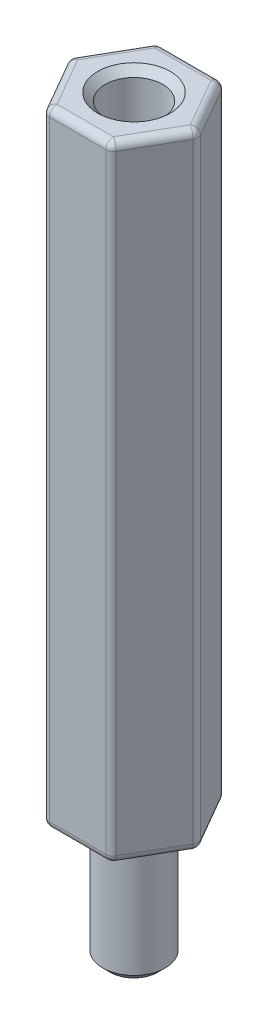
ISO-10303-21;
HEADER;
FILE_DESCRIPTION(('STEP AP214'),'2;1');
FILE_NAME('part.step','',(''),(''),'','','');
FILE_SCHEMA(('AUTOMOTIVE_DESIGN { 1 0 10303 214 1 1 1 1 }'));
ENDSEC;
DATA;
#1=APPLICATION_CONTEXT('core data for automotive mechanical design processes');
#2=APPLICATION_PROTOCOL_DEFINITION('international standard','automotive_design',2000,#1);
#3=PRODUCT_CONTEXT('',#1,'mechanical');
#4=PRODUCT('Part','Part','',(#3));
#5=PRODUCT_RELATED_PRODUCT_CATEGORY('part','',(#4));
#6=PRODUCT_DEFINITION_FORMATION('','',#4);
#7=PRODUCT_DEFINITION_CONTEXT('part definition',#1,'design');
#8=PRODUCT_DEFINITION('design','',#6,#7);
#9=PRODUCT_DEFINITION_SHAPE('','',#8);
#10=(LENGTH_UNIT() NAMED_UNIT(*) SI_UNIT(.MILLI.,.METRE.));
#11=(NAMED_UNIT(*) PLANE_ANGLE_UNIT() SI_UNIT($,.RADIAN.));
#12=(NAMED_UNIT(*) SI_UNIT($,.STERADIAN.) SOLID_ANGLE_UNIT());
#13=UNCERTAINTY_MEASURE_WITH_UNIT(LENGTH_MEASURE(1.E-05),#10,'distance_accuracy_value','');
#14=(GEOMETRIC_REPRESENTATION_CONTEXT(3) GLOBAL_UNCERTAINTY_ASSIGNED_CONTEXT((#13)) GLOBAL_UNIT_ASSIGNED_CONTEXT((#10,
#11,#12)) REPRESENTATION_CONTEXT('',''));
#15=CARTESIAN_POINT('',(0.,0.,0.));
#16=DIRECTION('',(0.,0.,1.));
#17=DIRECTION('',(1.,0.,0.));
#18=AXIS2_PLACEMENT_3D('',#15,#16,#17);
#19=CARTESIAN_POINT('',(0.,25.,0.));
#20=DIRECTION('',(0.,1.,0.));
#21=DIRECTION('',(0.,0.,1.));
#22=AXIS2_PLACEMENT_3D('',#19,#20,#21);
#23=PLANE('',#22);
#24=CARTESIAN_POINT('',(0.,25.,0.));
#25=DIRECTION('',(0.,1.,0.));
#26=DIRECTION('',(0.,0.,1.));
#27=AXIS2_PLACEMENT_3D('',#24,#25,#26);
#28=CIRCLE('',#27,1.45);
#29=CARTESIAN_POINT('',(0.,25.,1.45));
#30=VERTEX_POINT('',#29);
#31=EDGE_CURVE('E319',#30,#30,#28,.F.);
#32=ORIENTED_EDGE('',*,*,#31,.T.);
#33=EDGE_LOOP('',(#32));
#34=FACE_BOUND('',#33,.T.);
#35=DIRECTION('',(-0.5,0.,0.866025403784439));
#36=VECTOR('',#35,1.);
#37=CARTESIAN_POINT('',(-2.25166604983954,25.,0.));
#38=LINE('',#37,#36);
#39=CARTESIAN_POINT('',(-1.12583302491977,25.,-1.95));
#40=VERTEX_POINT('',#39);
#41=CARTESIAN_POINT('',(-2.25166604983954,25.,0.));
#42=VERTEX_POINT('',#41);
#43=EDGE_CURVE('E63',#40,#42,#38,.T.);
#44=ORIENTED_EDGE('',*,*,#43,.T.);
#45=DIRECTION('',(0.5,0.,0.866025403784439));
#46=VECTOR('',#45,1.);
#47=CARTESIAN_POINT('',(-1.12583302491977,25.,1.95));
#48=LINE('',#47,#46);
#49=CARTESIAN_POINT('',(-1.12583302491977,25.,1.95));
#50=VERTEX_POINT('',#49);
#51=EDGE_CURVE('E646',#42,#50,#48,.T.);
#52=ORIENTED_EDGE('',*,*,#51,.T.);
#53=DIRECTION('',(1.,0.,0.));
#54=VECTOR('',#53,1.);
#55=CARTESIAN_POINT('',(1.12583302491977,25.,1.95));
#56=LINE('',#55,#54);
#57=CARTESIAN_POINT('',(1.12583302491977,25.,1.95));
#58=VERTEX_POINT('',#57);
#59=EDGE_CURVE('E633',#50,#58,#56,.T.);
#60=ORIENTED_EDGE('',*,*,#59,.T.);
#61=DIRECTION('',(0.5,0.,-0.866025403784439));
#62=VECTOR('',#61,1.);
#63=CARTESIAN_POINT('',(2.25166604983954,25.,0.));
#64=LINE('',#63,#62);
#65=CARTESIAN_POINT('',(2.25166604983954,25.,0.));
#66=VERTEX_POINT('',#65);
#67=EDGE_CURVE('E636',#58,#66,#64,.T.);
#68=ORIENTED_EDGE('',*,*,#67,.T.);
#69=DIRECTION('',(-0.5,0.,-0.866025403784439));
#70=VECTOR('',#69,1.);
#71=CARTESIAN_POINT('',(1.12583302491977,25.,-1.95));
#72=LINE('',#71,#70);
#73=CARTESIAN_POINT('',(1.12583302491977,25.,-1.95));
#74=VERTEX_POINT('',#73);
#75=EDGE_CURVE('E639',#66,#74,#72,.T.);
#76=ORIENTED_EDGE('',*,*,#75,.T.);
#77=DIRECTION('',(-1.,0.,0.));
#78=VECTOR('',#77,1.);
#79=CARTESIAN_POINT('',(-1.12583302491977,25.,-1.95));
#80=LINE('',#79,#78);
#81=EDGE_CURVE('E68',#74,#40,#80,.T.);
#82=ORIENTED_EDGE('',*,*,#81,.T.);
#83=EDGE_LOOP('',(#44,#52,#60,#68,#76,#82));
#84=FACE_BOUND('',#83,.T.);
#85=ADVANCED_FACE('F47',(#34,#84),#23,.T.);
#86=CARTESIAN_POINT('',(0.,0.,0.));
#87=DIRECTION('',(0.,1.,0.));
#88=DIRECTION('',(0.,0.,1.));
#89=AXIS2_PLACEMENT_3D('',#86,#87,#88);
#90=PLANE('',#89);
#91=CARTESIAN_POINT('',(0.,0.,0.));
#92=DIRECTION('',(0.,1.,0.));
#93=DIRECTION('',(0.,0.,1.));
#94=AXIS2_PLACEMENT_3D('',#91,#92,#93);
#95=CIRCLE('',#94,1.55);
#96=CARTESIAN_POINT('',(0.,0.,1.55));
#97=VERTEX_POINT('',#96);
#98=EDGE_CURVE('E11',#97,#97,#95,.T.);
#99=ORIENTED_EDGE('',*,*,#98,.T.);
#100=EDGE_LOOP('',(#99));
#101=FACE_BOUND('',#100,.T.);
#102=DIRECTION('',(1.,0.,0.));
#103=VECTOR('',#102,1.);
#104=CARTESIAN_POINT('',(0.,0.,1.95));
#105=LINE('',#104,#103);
#106=CARTESIAN_POINT('',(1.12583302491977,0.,1.95));
#107=VERTEX_POINT('',#106);
#108=CARTESIAN_POINT('',(-1.12583302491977,0.,1.95));
#109=VERTEX_POINT('',#108);
#110=EDGE_CURVE('E184',#107,#109,#105,.F.);
#111=ORIENTED_EDGE('',*,*,#110,.T.);
#112=DIRECTION('',(0.5,0.,0.866025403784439));
#113=VECTOR('',#112,1.);
#114=CARTESIAN_POINT('',(-1.68874953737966,0.,0.974999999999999));
#115=LINE('',#114,#113);
#116=CARTESIAN_POINT('',(-2.25166604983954,0.,0.));
#117=VERTEX_POINT('',#116);
#118=EDGE_CURVE('E212',#109,#117,#115,.F.);
#119=ORIENTED_EDGE('',*,*,#118,.T.);
#120=DIRECTION('',(-0.5,0.,0.866025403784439));
#121=VECTOR('',#120,1.);
#122=CARTESIAN_POINT('',(-1.68874953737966,0.,-0.975));
#123=LINE('',#122,#121);
#124=CARTESIAN_POINT('',(-1.12583302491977,0.,-1.95));
#125=VERTEX_POINT('',#124);
#126=EDGE_CURVE('E574',#117,#125,#123,.F.);
#127=ORIENTED_EDGE('',*,*,#126,.T.);
#128=DIRECTION('',(-1.,0.,0.));
#129=VECTOR('',#128,1.);
#130=CARTESIAN_POINT('',(0.,0.,-1.95));
#131=LINE('',#130,#129);
#132=CARTESIAN_POINT('',(1.12583302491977,0.,-1.95));
#133=VERTEX_POINT('',#132);
#134=EDGE_CURVE('E571',#125,#133,#131,.F.);
#135=ORIENTED_EDGE('',*,*,#134,.T.);
#136=DIRECTION('',(-0.5,0.,-0.866025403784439));
#137=VECTOR('',#136,1.);
#138=CARTESIAN_POINT('',(1.68874953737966,0.,-0.975));
#139=LINE('',#138,#137);
#140=CARTESIAN_POINT('',(2.25166604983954,0.,0.));
#141=VERTEX_POINT('',#140);
#142=EDGE_CURVE('E568',#133,#141,#139,.F.);
#143=ORIENTED_EDGE('',*,*,#142,.T.);
#144=DIRECTION('',(0.5,0.,-0.866025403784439));
#145=VECTOR('',#144,1.);
#146=CARTESIAN_POINT('',(1.68874953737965,0.,0.975));
#147=LINE('',#146,#145);
#148=EDGE_CURVE('E565',#141,#107,#147,.F.);
#149=ORIENTED_EDGE('',*,*,#148,.T.);
#150=EDGE_LOOP('',(#111,#119,#127,#135,#143,#149));
#151=FACE_BOUND('',#150,.T.);
#152=ADVANCED_FACE('F339',(#101,#151),#90,.F.);
#153=CARTESIAN_POINT('',(1.29903810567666,25.,-2.25));
#154=DIRECTION('',(0.,0.,1.));
#155=DIRECTION('',(1.,0.,0.));
#156=AXIS2_PLACEMENT_3D('',#153,#154,#155);
#157=PLANE('',#156);
#158=DIRECTION('',(0.,-1.,0.));
#159=VECTOR('',#158,1.);
#160=CARTESIAN_POINT('',(1.12583302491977,25.,-2.25));
#161=LINE('',#160,#159);
#162=CARTESIAN_POINT('',(1.12583302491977,24.7,-2.25));
#163=VERTEX_POINT('',#162);
#164=CARTESIAN_POINT('',(1.12583302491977,0.300000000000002,-2.25));
#165=VERTEX_POINT('',#164);
#166=EDGE_CURVE('E521',#163,#165,#161,.T.);
#167=ORIENTED_EDGE('',*,*,#166,.T.);
#168=DIRECTION('',(-1.,0.,0.));
#169=VECTOR('',#168,1.);
#170=CARTESIAN_POINT('',(1.29903810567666,0.300000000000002,-2.25));
#171=LINE('',#170,#169);
#172=CARTESIAN_POINT('',(-1.12583302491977,0.300000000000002,-2.25));
#173=VERTEX_POINT('',#172);
#174=EDGE_CURVE('E600',#165,#173,#171,.T.);
#175=ORIENTED_EDGE('',*,*,#174,.T.);
#176=DIRECTION('',(0.,-1.,0.));
#177=VECTOR('',#176,1.);
#178=CARTESIAN_POINT('',(-1.12583302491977,25.,-2.25));
#179=LINE('',#178,#177);
#180=CARTESIAN_POINT('',(-1.12583302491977,24.7,-2.25));
#181=VERTEX_POINT('',#180);
#182=EDGE_CURVE('E517',#173,#181,#179,.F.);
#183=ORIENTED_EDGE('',*,*,#182,.T.);
#184=DIRECTION('',(-1.,0.,0.));
#185=VECTOR('',#184,1.);
#186=CARTESIAN_POINT('',(1.12583302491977,24.7,-2.25));
#187=LINE('',#186,#185);
#188=EDGE_CURVE('E597',#181,#163,#187,.F.);
#189=ORIENTED_EDGE('',*,*,#188,.T.);
#190=EDGE_LOOP('',(#167,#175,#183,#189));
#191=FACE_BOUND('',#190,.T.);
#192=ADVANCED_FACE('F345',(#191),#157,.F.);
#193=CARTESIAN_POINT('',(-1.29903810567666,25.,-2.25));
#194=DIRECTION('',(0.866025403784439,0.,0.5));
#195=DIRECTION('',(0.5,0.,-0.866025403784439));
#196=AXIS2_PLACEMENT_3D('',#193,#194,#195);
#197=PLANE('',#196);
#198=DIRECTION('',(0.,-1.,0.));
#199=VECTOR('',#198,1.);
#200=CARTESIAN_POINT('',(-1.3856406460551,25.,-2.1));
#201=LINE('',#200,#199);
#202=CARTESIAN_POINT('',(-1.3856406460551,24.7,-2.1));
#203=VERTEX_POINT('',#202);
#204=CARTESIAN_POINT('',(-1.3856406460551,0.300000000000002,-2.1));
#205=VERTEX_POINT('',#204);
#206=EDGE_CURVE('E198',#203,#205,#201,.T.);
#207=ORIENTED_EDGE('',*,*,#206,.T.);
#208=DIRECTION('',(-0.5,0.,0.866025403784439));
#209=VECTOR('',#208,1.);
#210=CARTESIAN_POINT('',(-1.29903810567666,0.300000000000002,-2.25));
#211=LINE('',#210,#209);
#212=CARTESIAN_POINT('',(-2.51147367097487,0.300000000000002,-0.150000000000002));
#213=VERTEX_POINT('',#212);
#214=EDGE_CURVE('E588',#205,#213,#211,.T.);
#215=ORIENTED_EDGE('',*,*,#214,.T.);
#216=DIRECTION('',(0.,-1.,0.));
#217=VECTOR('',#216,1.);
#218=CARTESIAN_POINT('',(-2.51147367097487,25.,-0.150000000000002));
#219=LINE('',#218,#217);
#220=CARTESIAN_POINT('',(-2.51147367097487,24.7,-0.150000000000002));
#221=VERTEX_POINT('',#220);
#222=EDGE_CURVE('E543',#213,#221,#219,.F.);
#223=ORIENTED_EDGE('',*,*,#222,.T.);
#224=DIRECTION('',(-0.5,0.,0.866025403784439));
#225=VECTOR('',#224,1.);
#226=CARTESIAN_POINT('',(-1.3856406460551,24.7,-2.1));
#227=LINE('',#226,#225);
#228=EDGE_CURVE('E585',#221,#203,#227,.F.);
#229=ORIENTED_EDGE('',*,*,#228,.T.);
#230=EDGE_LOOP('',(#207,#215,#223,#229));
#231=FACE_BOUND('',#230,.T.);
#232=ADVANCED_FACE('F366',(#231),#197,.F.);
#233=CARTESIAN_POINT('',(-2.59807621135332,25.,0.));
#234=DIRECTION('',(0.866025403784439,0.,-0.5));
#235=DIRECTION('',(-0.5,0.,-0.866025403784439));
#236=AXIS2_PLACEMENT_3D('',#233,#234,#235);
#237=PLANE('',#236);
#238=DIRECTION('',(0.,-1.,0.));
#239=VECTOR('',#238,1.);
#240=CARTESIAN_POINT('',(-2.51147367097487,25.,0.149999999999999));
#241=LINE('',#240,#239);
#242=CARTESIAN_POINT('',(-2.51147367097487,24.7,0.149999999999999));
#243=VERTEX_POINT('',#242);
#244=CARTESIAN_POINT('',(-2.51147367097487,0.300000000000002,0.149999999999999));
#245=VERTEX_POINT('',#244);
#246=EDGE_CURVE('E179',#243,#245,#241,.T.);
#247=ORIENTED_EDGE('',*,*,#246,.T.);
#248=DIRECTION('',(0.5,0.,0.866025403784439));
#249=VECTOR('',#248,1.);
#250=CARTESIAN_POINT('',(-2.59807621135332,0.300000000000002,0.));
#251=LINE('',#250,#249);
#252=CARTESIAN_POINT('',(-1.3856406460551,0.300000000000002,2.1));
#253=VERTEX_POINT('',#252);
#254=EDGE_CURVE('E174',#245,#253,#251,.T.);
#255=ORIENTED_EDGE('',*,*,#254,.T.);
#256=DIRECTION('',(0.,-1.,0.));
#257=VECTOR('',#256,1.);
#258=CARTESIAN_POINT('',(-1.3856406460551,25.,2.1));
#259=LINE('',#258,#257);
#260=CARTESIAN_POINT('',(-1.3856406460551,24.7,2.1));
#261=VERTEX_POINT('',#260);
#262=EDGE_CURVE('E177',#253,#261,#259,.F.);
#263=ORIENTED_EDGE('',*,*,#262,.T.);
#264=DIRECTION('',(0.5,0.,0.866025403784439));
#265=VECTOR('',#264,1.);
#266=CARTESIAN_POINT('',(-2.51147367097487,24.7,0.149999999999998));
#267=LINE('',#266,#265);
#268=EDGE_CURVE('E185',#261,#243,#267,.F.);
#269=ORIENTED_EDGE('',*,*,#268,.T.);
#270=EDGE_LOOP('',(#247,#255,#263,#269));
#271=FACE_BOUND('',#270,.T.);
#272=ADVANCED_FACE('F176',(#271),#237,.F.);
#273=CARTESIAN_POINT('',(-1.29903810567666,25.,2.25));
#274=DIRECTION('',(0.,0.,-1.));
#275=DIRECTION('',(-1.,0.,0.));
#276=AXIS2_PLACEMENT_3D('',#273,#274,#275);
#277=PLANE('',#276);
#278=DIRECTION('',(0.,-1.,0.));
#279=VECTOR('',#278,1.);
#280=CARTESIAN_POINT('',(-1.12583302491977,25.,2.25));
#281=LINE('',#280,#279);
#282=CARTESIAN_POINT('',(-1.12583302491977,24.7,2.25));
#283=VERTEX_POINT('',#282);
#284=CARTESIAN_POINT('',(-1.12583302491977,0.300000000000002,2.25));
#285=VERTEX_POINT('',#284);
#286=EDGE_CURVE('E556',#283,#285,#281,.T.);
#287=ORIENTED_EDGE('',*,*,#286,.T.);
#288=DIRECTION('',(1.,0.,0.));
#289=VECTOR('',#288,1.);
#290=CARTESIAN_POINT('',(-1.29903810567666,0.300000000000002,2.25));
#291=LINE('',#290,#289);
#292=CARTESIAN_POINT('',(1.12583302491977,0.300000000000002,2.25));
#293=VERTEX_POINT('',#292);
#294=EDGE_CURVE('E224',#285,#293,#291,.T.);
#295=ORIENTED_EDGE('',*,*,#294,.T.);
#296=DIRECTION('',(0.,-1.,0.));
#297=VECTOR('',#296,1.);
#298=CARTESIAN_POINT('',(1.12583302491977,25.,2.25));
#299=LINE('',#298,#297);
#300=CARTESIAN_POINT('',(1.12583302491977,24.7,2.25));
#301=VERTEX_POINT('',#300);
#302=EDGE_CURVE('E552',#293,#301,#299,.F.);
#303=ORIENTED_EDGE('',*,*,#302,.T.);
#304=DIRECTION('',(1.,0.,0.));
#305=VECTOR('',#304,1.);
#306=CARTESIAN_POINT('',(-1.12583302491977,24.7,2.25));
#307=LINE('',#306,#305);
#308=EDGE_CURVE('E648',#301,#283,#307,.F.);
#309=ORIENTED_EDGE('',*,*,#308,.T.);
#310=EDGE_LOOP('',(#287,#295,#303,#309));
#311=FACE_BOUND('',#310,.T.);
#312=ADVANCED_FACE('F359',(#311),#277,.F.);
#313=CARTESIAN_POINT('',(1.29903810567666,25.,2.25));
#314=DIRECTION('',(-0.866025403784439,0.,-0.5));
#315=DIRECTION('',(-0.5,0.,0.866025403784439));
#316=AXIS2_PLACEMENT_3D('',#313,#314,#315);
#317=PLANE('',#316);
#318=DIRECTION('',(0.,-1.,0.));
#319=VECTOR('',#318,1.);
#320=CARTESIAN_POINT('',(1.3856406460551,25.,2.1));
#321=LINE('',#320,#319);
#322=CARTESIAN_POINT('',(1.3856406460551,24.7,2.1));
#323=VERTEX_POINT('',#322);
#324=CARTESIAN_POINT('',(1.3856406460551,0.300000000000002,2.1));
#325=VERTEX_POINT('',#324);
#326=EDGE_CURVE('E535',#323,#325,#321,.T.);
#327=ORIENTED_EDGE('',*,*,#326,.T.);
#328=DIRECTION('',(0.5,0.,-0.866025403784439));
#329=VECTOR('',#328,1.);
#330=CARTESIAN_POINT('',(1.29903810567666,0.300000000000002,2.25));
#331=LINE('',#330,#329);
#332=CARTESIAN_POINT('',(2.51147367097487,0.300000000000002,0.149999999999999));
#333=VERTEX_POINT('',#332);
#334=EDGE_CURVE('E624',#325,#333,#331,.T.);
#335=ORIENTED_EDGE('',*,*,#334,.T.);
#336=DIRECTION('',(0.,-1.,0.));
#337=VECTOR('',#336,1.);
#338=CARTESIAN_POINT('',(2.51147367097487,25.,0.149999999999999));
#339=LINE('',#338,#337);
#340=CARTESIAN_POINT('',(2.51147367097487,24.7,0.149999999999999));
#341=VERTEX_POINT('',#340);
#342=EDGE_CURVE('E539',#333,#341,#339,.F.);
#343=ORIENTED_EDGE('',*,*,#342,.T.);
#344=DIRECTION('',(0.5,0.,-0.866025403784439));
#345=VECTOR('',#344,1.);
#346=CARTESIAN_POINT('',(1.3856406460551,24.7,2.1));
#347=LINE('',#346,#345);
#348=EDGE_CURVE('E621',#341,#323,#347,.F.);
#349=ORIENTED_EDGE('',*,*,#348,.T.);
#350=EDGE_LOOP('',(#327,#335,#343,#349));
#351=FACE_BOUND('',#350,.T.);
#352=ADVANCED_FACE('F355',(#351),#317,.F.);
#353=CARTESIAN_POINT('',(2.59807621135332,25.,0.));
#354=DIRECTION('',(-0.866025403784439,0.,0.5));
#355=DIRECTION('',(0.5,0.,0.866025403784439));
#356=AXIS2_PLACEMENT_3D('',#353,#354,#355);
#357=PLANE('',#356);
#358=DIRECTION('',(0.,-1.,0.));
#359=VECTOR('',#358,1.);
#360=CARTESIAN_POINT('',(2.51147367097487,25.,-0.150000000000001));
#361=LINE('',#360,#359);
#362=CARTESIAN_POINT('',(2.51147367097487,24.7,-0.150000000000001));
#363=VERTEX_POINT('',#362);
#364=CARTESIAN_POINT('',(2.51147367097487,0.300000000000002,-0.150000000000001));
#365=VERTEX_POINT('',#364);
#366=EDGE_CURVE('E527',#363,#365,#361,.T.);
#367=ORIENTED_EDGE('',*,*,#366,.T.);
#368=DIRECTION('',(-0.5,0.,-0.866025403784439));
#369=VECTOR('',#368,1.);
#370=CARTESIAN_POINT('',(2.59807621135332,0.300000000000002,0.));
#371=LINE('',#370,#369);
#372=CARTESIAN_POINT('',(1.3856406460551,0.300000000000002,-2.1));
#373=VERTEX_POINT('',#372);
#374=EDGE_CURVE('E612',#365,#373,#371,.T.);
#375=ORIENTED_EDGE('',*,*,#374,.T.);
#376=DIRECTION('',(0.,-1.,0.));
#377=VECTOR('',#376,1.);
#378=CARTESIAN_POINT('',(1.3856406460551,25.,-2.1));
#379=LINE('',#378,#377);
#380=CARTESIAN_POINT('',(1.3856406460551,24.7,-2.1));
#381=VERTEX_POINT('',#380);
#382=EDGE_CURVE('E531',#373,#381,#379,.F.);
#383=ORIENTED_EDGE('',*,*,#382,.T.);
#384=DIRECTION('',(-0.5,0.,-0.866025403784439));
#385=VECTOR('',#384,1.);
#386=CARTESIAN_POINT('',(2.51147367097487,24.7,-0.150000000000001));
#387=LINE('',#386,#385);
#388=EDGE_CURVE('E609',#381,#363,#387,.F.);
#389=ORIENTED_EDGE('',*,*,#388,.T.);
#390=EDGE_LOOP('',(#367,#375,#383,#389));
#391=FACE_BOUND('',#390,.T.);
#392=ADVANCED_FACE('F352',(#391),#357,.F.);
#393=CARTESIAN_POINT('',(0.,25.,0.));
#394=DIRECTION('',(0.,-1.,0.));
#395=DIRECTION('',(0.,0.,-1.));
#396=AXIS2_PLACEMENT_3D('',#393,#394,#395);
#397=CYLINDRICAL_SURFACE('',#396,1.15);
#398=CARTESIAN_POINT('',(0.,24.7,0.));
#399=DIRECTION('',(0.,1.,0.));
#400=DIRECTION('',(0.,0.,1.));
#401=AXIS2_PLACEMENT_3D('',#398,#399,#400);
#402=CIRCLE('',#401,1.15);
#403=CARTESIAN_POINT('',(0.,24.7,1.15));
#404=VERTEX_POINT('',#403);
#405=EDGE_CURVE('E315',#404,#404,#402,.T.);
#406=ORIENTED_EDGE('',*,*,#405,.T.);
#407=EDGE_LOOP('',(#406));
#408=FACE_BOUND('',#407,.T.);
#409=CARTESIAN_POINT('',(0.,0.,0.));
#410=DIRECTION('',(0.,1.,0.));
#411=DIRECTION('',(0.,0.,1.));
#412=AXIS2_PLACEMENT_3D('',#409,#410,#411);
#413=CIRCLE('',#412,1.15);
#414=CARTESIAN_POINT('',(0.,0.,1.15));
#415=VERTEX_POINT('',#414);
#416=EDGE_CURVE('E265',#415,#415,#413,.T.);
#417=ORIENTED_EDGE('',*,*,#416,.F.);
#418=EDGE_LOOP('',(#417));
#419=FACE_BOUND('',#418,.T.);
#420=ADVANCED_FACE('F349',(#408,#419),#397,.F.);
#421=CARTESIAN_POINT('',(1.12583302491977,25.,-1.95));
#422=DIRECTION('',(0.,-1.,0.));
#423=DIRECTION('',(0.,0.,-1.));
#424=AXIS2_PLACEMENT_3D('',#421,#422,#423);
#425=CYLINDRICAL_SURFACE('',#424,0.3);
#426=ORIENTED_EDGE('',*,*,#382,.F.);
#427=CARTESIAN_POINT('',(1.12583302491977,0.300000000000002,-1.95));
#428=DIRECTION('',(0.,-1.,0.));
#429=DIRECTION('',(0.,0.,-1.));
#430=AXIS2_PLACEMENT_3D('',#427,#428,#429);
#431=CIRCLE('',#430,0.3);
#432=EDGE_CURVE('E606',#373,#165,#431,.F.);
#433=ORIENTED_EDGE('',*,*,#432,.T.);
#434=ORIENTED_EDGE('',*,*,#166,.F.);
#435=CARTESIAN_POINT('',(1.12583302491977,24.7,-1.95));
#436=DIRECTION('',(0.,-1.,0.));
#437=DIRECTION('',(0.,0.,-1.));
#438=AXIS2_PLACEMENT_3D('',#435,#436,#437);
#439=CIRCLE('',#438,0.3);
#440=EDGE_CURVE('E603',#163,#381,#439,.T.);
#441=ORIENTED_EDGE('',*,*,#440,.T.);
#442=EDGE_LOOP('',(#426,#433,#434,#441));
#443=FACE_BOUND('',#442,.T.);
#444=ADVANCED_FACE('F373',(#443),#425,.T.);
#445=CARTESIAN_POINT('',(2.25166604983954,25.,0.));
#446=DIRECTION('',(0.,-1.,0.));
#447=DIRECTION('',(0.,0.,-1.));
#448=AXIS2_PLACEMENT_3D('',#445,#446,#447);
#449=CYLINDRICAL_SURFACE('',#448,0.3);
#450=ORIENTED_EDGE('',*,*,#342,.F.);
#451=CARTESIAN_POINT('',(2.25166604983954,0.300000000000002,0.));
#452=DIRECTION('',(0.,-1.,0.));
#453=DIRECTION('',(0.,0.,-1.));
#454=AXIS2_PLACEMENT_3D('',#451,#452,#453);
#455=CIRCLE('',#454,0.3);
#456=EDGE_CURVE('E618',#333,#365,#455,.F.);
#457=ORIENTED_EDGE('',*,*,#456,.T.);
#458=ORIENTED_EDGE('',*,*,#366,.F.);
#459=CARTESIAN_POINT('',(2.25166604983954,24.7,0.));
#460=DIRECTION('',(0.,-1.,0.));
#461=DIRECTION('',(0.,0.,-1.));
#462=AXIS2_PLACEMENT_3D('',#459,#460,#461);
#463=CIRCLE('',#462,0.3);
#464=EDGE_CURVE('E615',#363,#341,#463,.T.);
#465=ORIENTED_EDGE('',*,*,#464,.T.);
#466=EDGE_LOOP('',(#450,#457,#458,#465));
#467=FACE_BOUND('',#466,.T.);
#468=ADVANCED_FACE('F376',(#467),#449,.T.);
#469=CARTESIAN_POINT('',(-1.12583302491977,25.,-1.95));
#470=DIRECTION('',(0.,-1.,0.));
#471=DIRECTION('',(0.,0.,-1.));
#472=AXIS2_PLACEMENT_3D('',#469,#470,#471);
#473=CYLINDRICAL_SURFACE('',#472,0.3);
#474=ORIENTED_EDGE('',*,*,#182,.F.);
#475=CARTESIAN_POINT('',(-1.12583302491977,0.300000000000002,-1.95));
#476=DIRECTION('',(0.,-1.,0.));
#477=DIRECTION('',(0.,0.,-1.));
#478=AXIS2_PLACEMENT_3D('',#475,#476,#477);
#479=CIRCLE('',#478,0.3);
#480=EDGE_CURVE('E594',#173,#205,#479,.F.);
#481=ORIENTED_EDGE('',*,*,#480,.T.);
#482=ORIENTED_EDGE('',*,*,#206,.F.);
#483=CARTESIAN_POINT('',(-1.12583302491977,24.7,-1.95));
#484=DIRECTION('',(0.,-1.,0.));
#485=DIRECTION('',(0.,0.,-1.));
#486=AXIS2_PLACEMENT_3D('',#483,#484,#485);
#487=CIRCLE('',#486,0.3);
#488=EDGE_CURVE('E591',#203,#181,#487,.T.);
#489=ORIENTED_EDGE('',*,*,#488,.T.);
#490=EDGE_LOOP('',(#474,#481,#482,#489));
#491=FACE_BOUND('',#490,.T.);
#492=ADVANCED_FACE('F380',(#491),#473,.T.);
#493=CARTESIAN_POINT('',(-2.25166604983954,25.,0.));
#494=DIRECTION('',(0.,-1.,0.));
#495=DIRECTION('',(0.,0.,-1.));
#496=AXIS2_PLACEMENT_3D('',#493,#494,#495);
#497=CYLINDRICAL_SURFACE('',#496,0.3);
#498=ORIENTED_EDGE('',*,*,#222,.F.);
#499=CARTESIAN_POINT('',(-2.25166604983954,0.300000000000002,0.));
#500=DIRECTION('',(0.,-1.,0.));
#501=DIRECTION('',(0.,0.,-1.));
#502=AXIS2_PLACEMENT_3D('',#499,#500,#501);
#503=CIRCLE('',#502,0.3);
#504=EDGE_CURVE('E582',#213,#245,#503,.F.);
#505=ORIENTED_EDGE('',*,*,#504,.T.);
#506=ORIENTED_EDGE('',*,*,#246,.F.);
#507=CARTESIAN_POINT('',(-2.25166604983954,24.7,0.));
#508=DIRECTION('',(0.,-1.,0.));
#509=DIRECTION('',(0.,0.,-1.));
#510=AXIS2_PLACEMENT_3D('',#507,#508,#509);
#511=CIRCLE('',#510,0.3);
#512=EDGE_CURVE('E579',#243,#221,#511,.T.);
#513=ORIENTED_EDGE('',*,*,#512,.T.);
#514=EDGE_LOOP('',(#498,#505,#506,#513));
#515=FACE_BOUND('',#514,.T.);
#516=ADVANCED_FACE('F384',(#515),#497,.T.);
#517=CARTESIAN_POINT('',(-1.12583302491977,25.,1.95));
#518=DIRECTION('',(0.,-1.,0.));
#519=DIRECTION('',(0.,0.,-1.));
#520=AXIS2_PLACEMENT_3D('',#517,#518,#519);
#521=CYLINDRICAL_SURFACE('',#520,0.3);
#522=ORIENTED_EDGE('',*,*,#262,.F.);
#523=CARTESIAN_POINT('',(-1.12583302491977,0.300000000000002,1.95));
#524=DIRECTION('',(0.,-1.,0.));
#525=DIRECTION('',(0.,0.,-1.));
#526=AXIS2_PLACEMENT_3D('',#523,#524,#525);
#527=CIRCLE('',#526,0.3);
#528=EDGE_CURVE('E193',#253,#285,#527,.F.);
#529=ORIENTED_EDGE('',*,*,#528,.T.);
#530=ORIENTED_EDGE('',*,*,#286,.F.);
#531=CARTESIAN_POINT('',(-1.12583302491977,24.7,1.95));
#532=DIRECTION('',(0.,-1.,0.));
#533=DIRECTION('',(0.,0.,-1.));
#534=AXIS2_PLACEMENT_3D('',#531,#532,#533);
#535=CIRCLE('',#534,0.3);
#536=EDGE_CURVE('E196',#283,#261,#535,.T.);
#537=ORIENTED_EDGE('',*,*,#536,.T.);
#538=EDGE_LOOP('',(#522,#529,#530,#537));
#539=FACE_BOUND('',#538,.T.);
#540=ADVANCED_FACE('F191',(#539),#521,.T.);
#541=CARTESIAN_POINT('',(1.12583302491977,25.,1.95));
#542=DIRECTION('',(0.,-1.,0.));
#543=DIRECTION('',(0.,0.,-1.));
#544=AXIS2_PLACEMENT_3D('',#541,#542,#543);
#545=CYLINDRICAL_SURFACE('',#544,0.3);
#546=ORIENTED_EDGE('',*,*,#302,.F.);
#547=CARTESIAN_POINT('',(1.12583302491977,0.300000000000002,1.95));
#548=DIRECTION('',(0.,-1.,0.));
#549=DIRECTION('',(0.,0.,-1.));
#550=AXIS2_PLACEMENT_3D('',#547,#548,#549);
#551=CIRCLE('',#550,0.3);
#552=EDGE_CURVE('E630',#293,#325,#551,.F.);
#553=ORIENTED_EDGE('',*,*,#552,.T.);
#554=ORIENTED_EDGE('',*,*,#326,.F.);
#555=CARTESIAN_POINT('',(1.12583302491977,24.7,1.95));
#556=DIRECTION('',(0.,-1.,0.));
#557=DIRECTION('',(0.,0.,-1.));
#558=AXIS2_PLACEMENT_3D('',#555,#556,#557);
#559=CIRCLE('',#558,0.3);
#560=EDGE_CURVE('E627',#323,#301,#559,.T.);
#561=ORIENTED_EDGE('',*,*,#560,.T.);
#562=EDGE_LOOP('',(#546,#553,#554,#561));
#563=FACE_BOUND('',#562,.T.);
#564=ADVANCED_FACE('F391',(#563),#545,.T.);
#565=CARTESIAN_POINT('',(1.12583302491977,0.300000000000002,-1.95));
#566=DIRECTION('',(0.,1.,0.));
#567=DIRECTION('',(0.,0.,1.));
#568=AXIS2_PLACEMENT_3D('',#565,#566,#567);
#569=SPHERICAL_SURFACE('',#568,0.3);
#570=CARTESIAN_POINT('',(1.12583302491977,0.300000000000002,-1.95));
#571=DIRECTION('',(-1.,0.,0.));
#572=DIRECTION('',(0.,0.,1.));
#573=AXIS2_PLACEMENT_3D('',#570,#571,#572);
#574=CIRCLE('',#573,0.3);
#575=EDGE_CURVE('E257',#165,#133,#574,.T.);
#576=ORIENTED_EDGE('',*,*,#575,.F.);
#577=ORIENTED_EDGE('',*,*,#432,.F.);
#578=CARTESIAN_POINT('',(1.12583302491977,0.300000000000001,-1.95));
#579=DIRECTION('',(0.5,0.,0.866025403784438));
#580=DIRECTION('',(0.866025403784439,0.,-0.5));
#581=AXIS2_PLACEMENT_3D('',#578,#579,#580);
#582=CIRCLE('',#581,0.3);
#583=EDGE_CURVE('E261',#133,#373,#582,.T.);
#584=ORIENTED_EDGE('',*,*,#583,.F.);
#585=EDGE_LOOP('',(#576,#577,#584));
#586=FACE_BOUND('',#585,.T.);
#587=ADVANCED_FACE('F394',(#586),#569,.T.);
#588=CARTESIAN_POINT('',(2.33826859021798,0.300000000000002,0.149999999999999));
#589=DIRECTION('',(-0.5,0.,-0.866025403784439));
#590=DIRECTION('',(-0.866025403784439,0.,0.5));
#591=AXIS2_PLACEMENT_3D('',#588,#589,#590);
#592=CYLINDRICAL_SURFACE('',#591,0.3);
#593=ORIENTED_EDGE('',*,*,#583,.T.);
#594=ORIENTED_EDGE('',*,*,#374,.F.);
#595=CARTESIAN_POINT('',(2.25166604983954,0.3,0.));
#596=DIRECTION('',(0.5,0.,0.866025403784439));
#597=DIRECTION('',(0.866025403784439,0.,-0.5));
#598=AXIS2_PLACEMENT_3D('',#595,#596,#597);
#599=CIRCLE('',#598,0.3);
#600=EDGE_CURVE('E253',#141,#365,#599,.T.);
#601=ORIENTED_EDGE('',*,*,#600,.F.);
#602=ORIENTED_EDGE('',*,*,#142,.F.);
#603=EDGE_LOOP('',(#593,#594,#601,#602));
#604=FACE_BOUND('',#603,.T.);
#605=ADVANCED_FACE('F432',(#604),#592,.T.);
#606=CARTESIAN_POINT('',(1.29903810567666,0.300000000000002,-1.95));
#607=DIRECTION('',(-1.,0.,0.));
#608=DIRECTION('',(0.,0.,1.));
#609=AXIS2_PLACEMENT_3D('',#606,#607,#608);
#610=CYLINDRICAL_SURFACE('',#609,0.3);
#611=ORIENTED_EDGE('',*,*,#575,.T.);
#612=ORIENTED_EDGE('',*,*,#134,.F.);
#613=CARTESIAN_POINT('',(-1.12583302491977,0.300000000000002,-1.95));
#614=DIRECTION('',(-1.,0.,0.));
#615=DIRECTION('',(0.,-1.,0.));
#616=AXIS2_PLACEMENT_3D('',#613,#614,#615);
#617=CIRCLE('',#616,0.3);
#618=EDGE_CURVE('E249',#173,#125,#617,.T.);
#619=ORIENTED_EDGE('',*,*,#618,.F.);
#620=ORIENTED_EDGE('',*,*,#174,.F.);
#621=EDGE_LOOP('',(#611,#612,#619,#620));
#622=FACE_BOUND('',#621,.T.);
#623=ADVANCED_FACE('F428',(#622),#610,.T.);
#624=CARTESIAN_POINT('',(2.25166604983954,0.300000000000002,0.));
#625=DIRECTION('',(0.,1.,0.));
#626=DIRECTION('',(0.,0.,1.));
#627=AXIS2_PLACEMENT_3D('',#624,#625,#626);
#628=SPHERICAL_SURFACE('',#627,0.3);
#629=ORIENTED_EDGE('',*,*,#600,.T.);
#630=ORIENTED_EDGE('',*,*,#456,.F.);
#631=CARTESIAN_POINT('',(2.25166604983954,0.300000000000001,0.));
#632=DIRECTION('',(-0.499999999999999,0.,0.866025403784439));
#633=DIRECTION('',(0.866025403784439,0.,0.499999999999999));
#634=AXIS2_PLACEMENT_3D('',#631,#632,#633);
#635=CIRCLE('',#634,0.3);
#636=EDGE_CURVE('E245',#141,#333,#635,.T.);
#637=ORIENTED_EDGE('',*,*,#636,.F.);
#638=EDGE_LOOP('',(#629,#630,#637));
#639=FACE_BOUND('',#638,.T.);
#640=ADVANCED_FACE('F424',(#639),#628,.T.);
#641=CARTESIAN_POINT('',(-1.12583302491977,0.300000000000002,-1.95));
#642=DIRECTION('',(0.,1.,0.));
#643=DIRECTION('',(0.,0.,1.));
#644=AXIS2_PLACEMENT_3D('',#641,#642,#643);
#645=SPHERICAL_SURFACE('',#644,0.3);
#646=ORIENTED_EDGE('',*,*,#480,.F.);
#647=ORIENTED_EDGE('',*,*,#618,.T.);
#648=CARTESIAN_POINT('',(-1.12583302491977,0.300000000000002,-1.95));
#649=DIRECTION('',(-0.5,0.,0.866025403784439));
#650=DIRECTION('',(0.866025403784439,0.,0.5));
#651=AXIS2_PLACEMENT_3D('',#648,#649,#650);
#652=CIRCLE('',#651,0.3);
#653=EDGE_CURVE('E241',#205,#125,#652,.T.);
#654=ORIENTED_EDGE('',*,*,#653,.F.);
#655=EDGE_LOOP('',(#646,#647,#654));
#656=FACE_BOUND('',#655,.T.);
#657=ADVANCED_FACE('F420',(#656),#645,.T.);
#658=CARTESIAN_POINT('',(1.03923048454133,0.300000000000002,2.1));
#659=DIRECTION('',(0.5,0.,-0.866025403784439));
#660=DIRECTION('',(-0.866025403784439,0.,-0.5));
#661=AXIS2_PLACEMENT_3D('',#658,#659,#660);
#662=CYLINDRICAL_SURFACE('',#661,0.3);
#663=ORIENTED_EDGE('',*,*,#636,.T.);
#664=ORIENTED_EDGE('',*,*,#334,.F.);
#665=CARTESIAN_POINT('',(1.12583302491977,0.3,1.95));
#666=DIRECTION('',(-0.5,0.,0.866025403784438));
#667=DIRECTION('',(0.866025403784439,0.,0.5));
#668=AXIS2_PLACEMENT_3D('',#665,#666,#667);
#669=CIRCLE('',#668,0.3);
#670=EDGE_CURVE('E237',#107,#325,#669,.T.);
#671=ORIENTED_EDGE('',*,*,#670,.F.);
#672=ORIENTED_EDGE('',*,*,#148,.F.);
#673=EDGE_LOOP('',(#663,#664,#671,#672));
#674=FACE_BOUND('',#673,.T.);
#675=ADVANCED_FACE('F416',(#674),#662,.T.);
#676=CARTESIAN_POINT('',(-1.03923048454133,0.300000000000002,-2.1));
#677=DIRECTION('',(-0.5,0.,0.866025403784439));
#678=DIRECTION('',(0.866025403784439,0.,0.5));
#679=AXIS2_PLACEMENT_3D('',#676,#677,#678);
#680=CYLINDRICAL_SURFACE('',#679,0.3);
#681=ORIENTED_EDGE('',*,*,#653,.T.);
#682=ORIENTED_EDGE('',*,*,#126,.F.);
#683=CARTESIAN_POINT('',(-2.25166604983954,0.300000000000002,0.));
#684=DIRECTION('',(-0.5,0.,0.866025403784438));
#685=DIRECTION('',(0.866025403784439,0.,0.5));
#686=AXIS2_PLACEMENT_3D('',#683,#684,#685);
#687=CIRCLE('',#686,0.3);
#688=EDGE_CURVE('E233',#213,#117,#687,.T.);
#689=ORIENTED_EDGE('',*,*,#688,.F.);
#690=ORIENTED_EDGE('',*,*,#214,.F.);
#691=EDGE_LOOP('',(#681,#682,#689,#690));
#692=FACE_BOUND('',#691,.T.);
#693=ADVANCED_FACE('F412',(#692),#680,.T.);
#694=CARTESIAN_POINT('',(1.12583302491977,0.300000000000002,1.95));
#695=DIRECTION('',(0.,1.,0.));
#696=DIRECTION('',(0.,0.,1.));
#697=AXIS2_PLACEMENT_3D('',#694,#695,#696);
#698=SPHERICAL_SURFACE('',#697,0.3);
#699=ORIENTED_EDGE('',*,*,#670,.T.);
#700=ORIENTED_EDGE('',*,*,#552,.F.);
#701=CARTESIAN_POINT('',(1.12583302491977,0.300000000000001,1.95));
#702=DIRECTION('',(-1.,0.,0.));
#703=DIRECTION('',(0.,0.,1.));
#704=AXIS2_PLACEMENT_3D('',#701,#702,#703);
#705=CIRCLE('',#704,0.3);
#706=EDGE_CURVE('E229',#107,#293,#705,.T.);
#707=ORIENTED_EDGE('',*,*,#706,.F.);
#708=EDGE_LOOP('',(#699,#700,#707));
#709=FACE_BOUND('',#708,.T.);
#710=ADVANCED_FACE('F408',(#709),#698,.T.);
#711=CARTESIAN_POINT('',(-2.25166604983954,0.300000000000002,0.));
#712=DIRECTION('',(0.,1.,0.));
#713=DIRECTION('',(0.,0.,1.));
#714=AXIS2_PLACEMENT_3D('',#711,#712,#713);
#715=SPHERICAL_SURFACE('',#714,0.3);
#716=ORIENTED_EDGE('',*,*,#504,.F.);
#717=ORIENTED_EDGE('',*,*,#688,.T.);
#718=CARTESIAN_POINT('',(-2.25166604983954,0.300000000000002,0.));
#719=DIRECTION('',(0.499999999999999,0.,0.866025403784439));
#720=DIRECTION('',(0.866025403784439,0.,-0.499999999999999));
#721=AXIS2_PLACEMENT_3D('',#718,#719,#720);
#722=CIRCLE('',#721,0.3);
#723=EDGE_CURVE('E218',#245,#117,#722,.T.);
#724=ORIENTED_EDGE('',*,*,#723,.F.);
#725=EDGE_LOOP('',(#716,#717,#724));
#726=FACE_BOUND('',#725,.T.);
#727=ADVANCED_FACE('F404',(#726),#715,.T.);
#728=CARTESIAN_POINT('',(-1.29903810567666,0.300000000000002,1.95));
#729=DIRECTION('',(1.,0.,0.));
#730=DIRECTION('',(0.,0.,-1.));
#731=AXIS2_PLACEMENT_3D('',#728,#729,#730);
#732=CYLINDRICAL_SURFACE('',#731,0.3);
#733=ORIENTED_EDGE('',*,*,#706,.T.);
#734=ORIENTED_EDGE('',*,*,#294,.F.);
#735=CARTESIAN_POINT('',(-1.12583302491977,0.3,1.95));
#736=DIRECTION('',(-1.,0.,0.));
#737=DIRECTION('',(0.,0.,1.));
#738=AXIS2_PLACEMENT_3D('',#735,#736,#737);
#739=CIRCLE('',#738,0.3);
#740=EDGE_CURVE('E205',#109,#285,#739,.T.);
#741=ORIENTED_EDGE('',*,*,#740,.F.);
#742=ORIENTED_EDGE('',*,*,#110,.F.);
#743=EDGE_LOOP('',(#733,#734,#741,#742));
#744=FACE_BOUND('',#743,.T.);
#745=ADVANCED_FACE('F401',(#744),#732,.T.);
#746=CARTESIAN_POINT('',(-2.33826859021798,0.300000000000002,-0.150000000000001));
#747=DIRECTION('',(0.5,0.,0.866025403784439));
#748=DIRECTION('',(0.866025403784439,0.,-0.5));
#749=AXIS2_PLACEMENT_3D('',#746,#747,#748);
#750=CYLINDRICAL_SURFACE('',#749,0.3);
#751=ORIENTED_EDGE('',*,*,#723,.T.);
#752=ORIENTED_EDGE('',*,*,#118,.F.);
#753=CARTESIAN_POINT('',(-1.12583302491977,0.300000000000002,1.95));
#754=DIRECTION('',(0.5,0.,0.866025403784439));
#755=DIRECTION('',(0.866025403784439,0.,-0.5));
#756=AXIS2_PLACEMENT_3D('',#753,#754,#755);
#757=CIRCLE('',#756,0.3);
#758=EDGE_CURVE('E203',#253,#109,#757,.T.);
#759=ORIENTED_EDGE('',*,*,#758,.F.);
#760=ORIENTED_EDGE('',*,*,#254,.F.);
#761=EDGE_LOOP('',(#751,#752,#759,#760));
#762=FACE_BOUND('',#761,.T.);
#763=ADVANCED_FACE('F210',(#762),#750,.T.);
#764=CARTESIAN_POINT('',(-1.12583302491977,0.300000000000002,1.95));
#765=DIRECTION('',(0.,1.,0.));
#766=DIRECTION('',(0.,0.,1.));
#767=AXIS2_PLACEMENT_3D('',#764,#765,#766);
#768=SPHERICAL_SURFACE('',#767,0.3);
#769=ORIENTED_EDGE('',*,*,#740,.T.);
#770=ORIENTED_EDGE('',*,*,#528,.F.);
#771=ORIENTED_EDGE('',*,*,#758,.T.);
#772=EDGE_LOOP('',(#769,#770,#771));
#773=FACE_BOUND('',#772,.T.);
#774=ADVANCED_FACE('F202',(#773),#768,.T.);
#775=CARTESIAN_POINT('',(1.12583302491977,24.7,-1.95));
#776=DIRECTION('',(0.,1.,0.));
#777=DIRECTION('',(0.,0.,1.));
#778=AXIS2_PLACEMENT_3D('',#775,#776,#777);
#779=SPHERICAL_SURFACE('',#778,0.3);
#780=CARTESIAN_POINT('',(1.12583302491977,24.7,-1.95));
#781=DIRECTION('',(0.5,0.,0.866025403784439));
#782=DIRECTION('',(0.866025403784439,0.,-0.5));
#783=AXIS2_PLACEMENT_3D('',#780,#781,#782);
#784=CIRCLE('',#783,0.3);
#785=EDGE_CURVE('E221',#381,#74,#784,.T.);
#786=ORIENTED_EDGE('',*,*,#785,.F.);
#787=ORIENTED_EDGE('',*,*,#440,.F.);
#788=CARTESIAN_POINT('',(1.12583302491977,24.7,-1.95));
#789=DIRECTION('',(-1.,0.,0.));
#790=DIRECTION('',(0.,0.,1.));
#791=AXIS2_PLACEMENT_3D('',#788,#789,#790);
#792=CIRCLE('',#791,0.3);
#793=EDGE_CURVE('E214',#74,#163,#792,.T.);
#794=ORIENTED_EDGE('',*,*,#793,.F.);
#795=EDGE_LOOP('',(#786,#787,#794));
#796=FACE_BOUND('',#795,.T.);
#797=ADVANCED_FACE('F398',(#796),#779,.T.);
#798=CARTESIAN_POINT('',(0.,24.7,-1.95));
#799=DIRECTION('',(1.,0.,0.));
#800=DIRECTION('',(0.,0.,-1.));
#801=AXIS2_PLACEMENT_3D('',#798,#799,#800);
#802=CYLINDRICAL_SURFACE('',#801,0.3);
#803=ORIENTED_EDGE('',*,*,#793,.T.);
#804=ORIENTED_EDGE('',*,*,#188,.F.);
#805=CARTESIAN_POINT('',(-1.12583302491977,24.7,-1.95));
#806=DIRECTION('',(-1.,0.,0.));
#807=DIRECTION('',(0.,0.,1.));
#808=AXIS2_PLACEMENT_3D('',#805,#806,#807);
#809=CIRCLE('',#808,0.3);
#810=EDGE_CURVE('E300',#40,#181,#809,.T.);
#811=ORIENTED_EDGE('',*,*,#810,.F.);
#812=ORIENTED_EDGE('',*,*,#81,.F.);
#813=EDGE_LOOP('',(#803,#804,#811,#812));
#814=FACE_BOUND('',#813,.T.);
#815=ADVANCED_FACE('F480',(#814),#802,.T.);
#816=CARTESIAN_POINT('',(1.68874953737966,24.7,-0.975));
#817=DIRECTION('',(0.5,0.,0.866025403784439));
#818=DIRECTION('',(0.866025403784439,0.,-0.5));
#819=AXIS2_PLACEMENT_3D('',#816,#817,#818);
#820=CYLINDRICAL_SURFACE('',#819,0.3);
#821=ORIENTED_EDGE('',*,*,#785,.T.);
#822=ORIENTED_EDGE('',*,*,#75,.F.);
#823=CARTESIAN_POINT('',(2.25166604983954,24.7,0.));
#824=DIRECTION('',(0.5,0.,0.866025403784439));
#825=DIRECTION('',(0.866025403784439,0.,-0.5));
#826=AXIS2_PLACEMENT_3D('',#823,#824,#825);
#827=CIRCLE('',#826,0.3);
#828=EDGE_CURVE('E296',#363,#66,#827,.T.);
#829=ORIENTED_EDGE('',*,*,#828,.F.);
#830=ORIENTED_EDGE('',*,*,#388,.F.);
#831=EDGE_LOOP('',(#821,#822,#829,#830));
#832=FACE_BOUND('',#831,.T.);
#833=ADVANCED_FACE('F476',(#832),#820,.T.);
#834=CARTESIAN_POINT('',(-1.12583302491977,24.7,-1.95));
#835=DIRECTION('',(0.,1.,0.));
#836=DIRECTION('',(0.,0.,1.));
#837=AXIS2_PLACEMENT_3D('',#834,#835,#836);
#838=SPHERICAL_SURFACE('',#837,0.3);
#839=ORIENTED_EDGE('',*,*,#810,.T.);
#840=ORIENTED_EDGE('',*,*,#488,.F.);
#841=CARTESIAN_POINT('',(-1.12583302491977,24.7,-1.95));
#842=DIRECTION('',(-0.5,0.,0.866025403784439));
#843=DIRECTION('',(0.866025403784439,0.,0.5));
#844=AXIS2_PLACEMENT_3D('',#841,#842,#843);
#845=CIRCLE('',#844,0.3);
#846=EDGE_CURVE('E292',#40,#203,#845,.T.);
#847=ORIENTED_EDGE('',*,*,#846,.F.);
#848=EDGE_LOOP('',(#839,#840,#847));
#849=FACE_BOUND('',#848,.T.);
#850=ADVANCED_FACE('F472',(#849),#838,.T.);
#851=CARTESIAN_POINT('',(2.25166604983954,24.7,0.));
#852=DIRECTION('',(0.,1.,0.));
#853=DIRECTION('',(0.,0.,1.));
#854=AXIS2_PLACEMENT_3D('',#851,#852,#853);
#855=SPHERICAL_SURFACE('',#854,0.3);
#856=ORIENTED_EDGE('',*,*,#464,.F.);
#857=ORIENTED_EDGE('',*,*,#828,.T.);
#858=CARTESIAN_POINT('',(2.25166604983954,24.7,0.));
#859=DIRECTION('',(-0.499999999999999,0.,0.866025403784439));
#860=DIRECTION('',(0.866025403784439,0.,0.499999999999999));
#861=AXIS2_PLACEMENT_3D('',#858,#859,#860);
#862=CIRCLE('',#861,0.3);
#863=EDGE_CURVE('E288',#341,#66,#862,.T.);
#864=ORIENTED_EDGE('',*,*,#863,.F.);
#865=EDGE_LOOP('',(#856,#857,#864));
#866=FACE_BOUND('',#865,.T.);
#867=ADVANCED_FACE('F468',(#866),#855,.T.);
#868=CARTESIAN_POINT('',(-1.68874953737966,24.7,-0.975));
#869=DIRECTION('',(0.5,0.,-0.866025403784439));
#870=DIRECTION('',(-0.866025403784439,0.,-0.5));
#871=AXIS2_PLACEMENT_3D('',#868,#869,#870);
#872=CYLINDRICAL_SURFACE('',#871,0.3);
#873=ORIENTED_EDGE('',*,*,#846,.T.);
#874=ORIENTED_EDGE('',*,*,#228,.F.);
#875=CARTESIAN_POINT('',(-2.25166604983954,24.7,0.));
#876=DIRECTION('',(-0.500000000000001,0.,0.866025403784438));
#877=DIRECTION('',(0.866025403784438,0.,0.500000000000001));
#878=AXIS2_PLACEMENT_3D('',#875,#876,#877);
#879=CIRCLE('',#878,0.3);
#880=EDGE_CURVE('E284',#42,#221,#879,.T.);
#881=ORIENTED_EDGE('',*,*,#880,.F.);
#882=ORIENTED_EDGE('',*,*,#43,.F.);
#883=EDGE_LOOP('',(#873,#874,#881,#882));
#884=FACE_BOUND('',#883,.T.);
#885=ADVANCED_FACE('F464',(#884),#872,.T.);
#886=CARTESIAN_POINT('',(1.68874953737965,24.7,0.975));
#887=DIRECTION('',(-0.5,0.,0.866025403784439));
#888=DIRECTION('',(0.866025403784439,0.,0.5));
#889=AXIS2_PLACEMENT_3D('',#886,#887,#888);
#890=CYLINDRICAL_SURFACE('',#889,0.3);
#891=ORIENTED_EDGE('',*,*,#863,.T.);
#892=ORIENTED_EDGE('',*,*,#67,.F.);
#893=CARTESIAN_POINT('',(1.12583302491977,24.7,1.95));
#894=DIRECTION('',(-0.5,0.,0.866025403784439));
#895=DIRECTION('',(0.866025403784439,0.,0.5));
#896=AXIS2_PLACEMENT_3D('',#893,#894,#895);
#897=CIRCLE('',#896,0.3);
#898=EDGE_CURVE('E280',#323,#58,#897,.T.);
#899=ORIENTED_EDGE('',*,*,#898,.F.);
#900=ORIENTED_EDGE('',*,*,#348,.F.);
#901=EDGE_LOOP('',(#891,#892,#899,#900));
#902=FACE_BOUND('',#901,.T.);
#903=ADVANCED_FACE('F460',(#902),#890,.T.);
#904=CARTESIAN_POINT('',(-2.25166604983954,24.7,0.));
#905=DIRECTION('',(0.,1.,0.));
#906=DIRECTION('',(0.,0.,1.));
#907=AXIS2_PLACEMENT_3D('',#904,#905,#906);
#908=SPHERICAL_SURFACE('',#907,0.3);
#909=ORIENTED_EDGE('',*,*,#880,.T.);
#910=ORIENTED_EDGE('',*,*,#512,.F.);
#911=CARTESIAN_POINT('',(-2.25166604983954,24.7,0.));
#912=DIRECTION('',(0.5,0.,0.866025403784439));
#913=DIRECTION('',(0.866025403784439,0.,-0.5));
#914=AXIS2_PLACEMENT_3D('',#911,#912,#913);
#915=CIRCLE('',#914,0.3);
#916=EDGE_CURVE('E276',#42,#243,#915,.T.);
#917=ORIENTED_EDGE('',*,*,#916,.F.);
#918=EDGE_LOOP('',(#909,#910,#917));
#919=FACE_BOUND('',#918,.T.);
#920=ADVANCED_FACE('F456',(#919),#908,.T.);
#921=CARTESIAN_POINT('',(1.12583302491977,24.7,1.95));
#922=DIRECTION('',(0.,1.,0.));
#923=DIRECTION('',(0.,0.,1.));
#924=AXIS2_PLACEMENT_3D('',#921,#922,#923);
#925=SPHERICAL_SURFACE('',#924,0.3);
#926=ORIENTED_EDGE('',*,*,#560,.F.);
#927=ORIENTED_EDGE('',*,*,#898,.T.);
#928=CARTESIAN_POINT('',(1.12583302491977,24.7,1.95));
#929=DIRECTION('',(-1.,0.,0.));
#930=DIRECTION('',(0.,0.,1.));
#931=AXIS2_PLACEMENT_3D('',#928,#929,#930);
#932=CIRCLE('',#931,0.3);
#933=EDGE_CURVE('E272',#301,#58,#932,.T.);
#934=ORIENTED_EDGE('',*,*,#933,.F.);
#935=EDGE_LOOP('',(#926,#927,#934));
#936=FACE_BOUND('',#935,.T.);
#937=ADVANCED_FACE('F452',(#936),#925,.T.);
#938=CARTESIAN_POINT('',(-1.68874953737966,24.7,0.974999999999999));
#939=DIRECTION('',(-0.5,0.,-0.866025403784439));
#940=DIRECTION('',(-0.866025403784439,0.,0.5));
#941=AXIS2_PLACEMENT_3D('',#938,#939,#940);
#942=CYLINDRICAL_SURFACE('',#941,0.3);
#943=ORIENTED_EDGE('',*,*,#916,.T.);
#944=ORIENTED_EDGE('',*,*,#268,.F.);
#945=CARTESIAN_POINT('',(-1.12583302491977,24.7,1.95));
#946=DIRECTION('',(0.499999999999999,0.,0.866025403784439));
#947=DIRECTION('',(0.866025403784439,0.,-0.499999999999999));
#948=AXIS2_PLACEMENT_3D('',#945,#946,#947);
#949=CIRCLE('',#948,0.3);
#950=EDGE_CURVE('E269',#50,#261,#949,.T.);
#951=ORIENTED_EDGE('',*,*,#950,.F.);
#952=ORIENTED_EDGE('',*,*,#51,.F.);
#953=EDGE_LOOP('',(#943,#944,#951,#952));
#954=FACE_BOUND('',#953,.T.);
#955=ADVANCED_FACE('F448',(#954),#942,.T.);
#956=CARTESIAN_POINT('',(0.,24.7,1.95));
#957=DIRECTION('',(-1.,0.,0.));
#958=DIRECTION('',(0.,0.,1.));
#959=AXIS2_PLACEMENT_3D('',#956,#957,#958);
#960=CYLINDRICAL_SURFACE('',#959,0.3);
#961=ORIENTED_EDGE('',*,*,#933,.T.);
#962=ORIENTED_EDGE('',*,*,#59,.F.);
#963=CARTESIAN_POINT('',(-1.12583302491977,24.7,1.95));
#964=DIRECTION('',(-1.,0.,0.));
#965=DIRECTION('',(0.,0.,1.));
#966=AXIS2_PLACEMENT_3D('',#963,#964,#965);
#967=CIRCLE('',#966,0.3);
#968=EDGE_CURVE('E266',#283,#50,#967,.T.);
#969=ORIENTED_EDGE('',*,*,#968,.F.);
#970=ORIENTED_EDGE('',*,*,#308,.F.);
#971=EDGE_LOOP('',(#961,#962,#969,#970));
#972=FACE_BOUND('',#971,.T.);
#973=ADVANCED_FACE('F444',(#972),#960,.T.);
#974=CARTESIAN_POINT('',(-1.12583302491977,24.7,1.95));
#975=DIRECTION('',(0.,1.,0.));
#976=DIRECTION('',(0.,0.,1.));
#977=AXIS2_PLACEMENT_3D('',#974,#975,#976);
#978=SPHERICAL_SURFACE('',#977,0.3);
#979=ORIENTED_EDGE('',*,*,#950,.T.);
#980=ORIENTED_EDGE('',*,*,#536,.F.);
#981=ORIENTED_EDGE('',*,*,#968,.T.);
#982=EDGE_LOOP('',(#979,#980,#981));
#983=FACE_BOUND('',#982,.T.);
#984=ADVANCED_FACE('F440',(#983),#978,.T.);
#985=CARTESIAN_POINT('',(0.,0.,0.));
#986=DIRECTION('',(0.,-1.,0.));
#987=DIRECTION('',(0.,0.,-1.));
#988=AXIS2_PLACEMENT_3D('',#985,#986,#987);
#989=PLANE('',#988);
#990=ORIENTED_EDGE('',*,*,#416,.T.);
#991=EDGE_LOOP('',(#990));
#992=FACE_BOUND('',#991,.T.);
#993=ADVANCED_FACE('F443',(#992),#989,.F.);
#994=CARTESIAN_POINT('',(0.,-5.,0.));
#995=DIRECTION('',(0.,1.,0.));
#996=DIRECTION('',(0.,0.,1.));
#997=AXIS2_PLACEMENT_3D('',#994,#995,#996);
#998=CYLINDRICAL_SURFACE('',#997,1.25);
#999=CARTESIAN_POINT('',(0.,-0.3,0.));
#1000=DIRECTION('',(0.,1.,0.));
#1001=DIRECTION('',(0.,0.,1.));
#1002=AXIS2_PLACEMENT_3D('',#999,#1000,#1001);
#1003=CIRCLE('',#1002,1.25);
#1004=CARTESIAN_POINT('',(0.,-0.3,1.25));
#1005=VERTEX_POINT('',#1004);
#1006=EDGE_CURVE('E56',#1005,#1005,#1003,.F.);
#1007=ORIENTED_EDGE('',*,*,#1006,.T.);
#1008=EDGE_LOOP('',(#1007));
#1009=FACE_BOUND('',#1008,.T.);
#1010=CARTESIAN_POINT('',(0.,-4.69999999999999,0.));
#1011=DIRECTION('',(0.,-1.,0.));
#1012=DIRECTION('',(0.,0.,-1.));
#1013=AXIS2_PLACEMENT_3D('',#1010,#1011,#1012);
#1014=CIRCLE('',#1013,1.25);
#1015=CARTESIAN_POINT('',(0.,-4.69999999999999,1.25));
#1016=VERTEX_POINT('',#1015);
#1017=EDGE_CURVE('E311',#1016,#1016,#1014,.F.);
#1018=ORIENTED_EDGE('',*,*,#1017,.T.);
#1019=EDGE_LOOP('',(#1018));
#1020=FACE_BOUND('',#1019,.T.);
#1021=ADVANCED_FACE('F326',(#1009,#1020),#998,.T.);
#1022=CARTESIAN_POINT('',(0.,-5.,0.));
#1023=DIRECTION('',(0.,-1.,0.));
#1024=DIRECTION('',(0.,0.,-1.));
#1025=AXIS2_PLACEMENT_3D('',#1022,#1023,#1024);
#1026=PLANE('',#1025);
#1027=CARTESIAN_POINT('',(0.,-5.,0.));
#1028=DIRECTION('',(0.,-1.,0.));
#1029=DIRECTION('',(0.,0.,-1.));
#1030=AXIS2_PLACEMENT_3D('',#1027,#1028,#1029);
#1031=CIRCLE('',#1030,0.949999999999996);
#1032=CARTESIAN_POINT('',(0.,-5.,0.949999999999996));
#1033=VERTEX_POINT('',#1032);
#1034=EDGE_CURVE('E307',#1033,#1033,#1031,.T.);
#1035=ORIENTED_EDGE('',*,*,#1034,.T.);
#1036=EDGE_LOOP('',(#1035));
#1037=FACE_BOUND('',#1036,.T.);
#1038=ADVANCED_FACE('F493',(#1037),#1026,.T.);
#1039=CARTESIAN_POINT('',(0.,-5.,0.));
#1040=DIRECTION('',(0.,1.,0.));
#1041=DIRECTION('',(0.,0.,1.));
#1042=AXIS2_PLACEMENT_3D('',#1039,#1040,#1041);
#1043=CONICAL_SURFACE('',#1042,0.949999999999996,0.785398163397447);
#1044=CARTESIAN_POINT('',(0.,-4.69999999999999,1.25));
#1045=CARTESIAN_POINT('',(0.,-4.703125,1.246875));
#1046=CARTESIAN_POINT('',(0.,-4.70625,1.24375));
#1047=CARTESIAN_POINT('',(0.,-4.71249999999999,1.2375));
#1048=CARTESIAN_POINT('',(0.,-4.71562499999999,1.234375));
#1049=CARTESIAN_POINT('',(0.,-4.721875,1.228125));
#1050=CARTESIAN_POINT('',(0.,-4.725,1.225));
#1051=CARTESIAN_POINT('',(0.,-4.73124999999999,1.21875));
#1052=CARTESIAN_POINT('',(0.,-4.734375,1.215625));
#1053=CARTESIAN_POINT('',(0.,-4.740625,1.209375));
#1054=CARTESIAN_POINT('',(0.,-4.74375,1.20625));
#1055=CARTESIAN_POINT('',(0.,-4.75,1.2));
#1056=CARTESIAN_POINT('',(0.,-4.753125,1.196875));
#1057=CARTESIAN_POINT('',(0.,-4.759375,1.190625));
#1058=CARTESIAN_POINT('',(0.,-4.7625,1.1875));
#1059=CARTESIAN_POINT('',(0.,-4.76875,1.18125));
#1060=CARTESIAN_POINT('',(0.,-4.771875,1.178125));
#1061=CARTESIAN_POINT('',(0.,-4.778125,1.171875));
#1062=CARTESIAN_POINT('',(0.,-4.78125,1.16875));
#1063=CARTESIAN_POINT('',(0.,-4.7875,1.1625));
#1064=CARTESIAN_POINT('',(0.,-4.790625,1.159375));
#1065=CARTESIAN_POINT('',(0.,-4.796875,1.153125));
#1066=CARTESIAN_POINT('',(0.,-4.8,1.15));
#1067=CARTESIAN_POINT('',(0.,-4.80625,1.14375));
#1068=CARTESIAN_POINT('',(0.,-4.809375,1.140625));
#1069=CARTESIAN_POINT('',(0.,-4.815625,1.134375));
#1070=CARTESIAN_POINT('',(0.,-4.81875,1.13125));
#1071=CARTESIAN_POINT('',(0.,-4.825,1.125));
#1072=CARTESIAN_POINT('',(0.,-4.828125,1.121875));
#1073=CARTESIAN_POINT('',(0.,-4.834375,1.115625));
#1074=CARTESIAN_POINT('',(0.,-4.8375,1.1125));
#1075=CARTESIAN_POINT('',(0.,-4.84375,1.10625));
#1076=CARTESIAN_POINT('',(0.,-4.846875,1.103125));
#1077=CARTESIAN_POINT('',(0.,-4.853125,1.096875));
#1078=CARTESIAN_POINT('',(0.,-4.85625,1.09375));
#1079=CARTESIAN_POINT('',(0.,-4.8625,1.0875));
#1080=CARTESIAN_POINT('',(0.,-4.865625,1.084375));
#1081=CARTESIAN_POINT('',(0.,-4.871875,1.078125));
#1082=CARTESIAN_POINT('',(0.,-4.875,1.075));
#1083=CARTESIAN_POINT('',(0.,-4.88125,1.06875));
#1084=CARTESIAN_POINT('',(0.,-4.884375,1.065625));
#1085=CARTESIAN_POINT('',(0.,-4.890625,1.059375));
#1086=CARTESIAN_POINT('',(0.,-4.89375,1.05625));
#1087=CARTESIAN_POINT('',(0.,-4.9,1.05));
#1088=CARTESIAN_POINT('',(0.,-4.903125,1.046875));
#1089=CARTESIAN_POINT('',(0.,-4.909375,1.040625));
#1090=CARTESIAN_POINT('',(0.,-4.9125,1.0375));
#1091=CARTESIAN_POINT('',(0.,-4.91875,1.03125));
#1092=CARTESIAN_POINT('',(0.,-4.921875,1.028125));
#1093=CARTESIAN_POINT('',(0.,-4.928125,1.021875));
#1094=CARTESIAN_POINT('',(0.,-4.93125,1.01875));
#1095=CARTESIAN_POINT('',(0.,-4.9375,1.0125));
#1096=CARTESIAN_POINT('',(0.,-4.940625,1.009375));
#1097=CARTESIAN_POINT('',(0.,-4.946875,1.003125));
#1098=CARTESIAN_POINT('',(0.,-4.95,0.999999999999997));
#1099=CARTESIAN_POINT('',(0.,-4.95625,0.993749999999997));
#1100=CARTESIAN_POINT('',(0.,-4.959375,0.990624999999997));
#1101=CARTESIAN_POINT('',(0.,-4.965625,0.984374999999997));
#1102=CARTESIAN_POINT('',(0.,-4.96875,0.981249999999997));
#1103=CARTESIAN_POINT('',(0.,-4.975,0.974999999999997));
#1104=CARTESIAN_POINT('',(0.,-4.978125,0.971874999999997));
#1105=CARTESIAN_POINT('',(0.,-4.984375,0.965624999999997));
#1106=CARTESIAN_POINT('',(0.,-4.9875,0.962499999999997));
#1107=CARTESIAN_POINT('',(0.,-4.99375,0.956249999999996));
#1108=CARTESIAN_POINT('',(0.,-4.996875,0.953124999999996));
#1109=CARTESIAN_POINT('',(0.,-5.,0.949999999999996));
#1110=B_SPLINE_CURVE_WITH_KNOTS('',3,(#1044,#1045,#1046,#1047,#1048,#1049,#1050,#1051,#1052,
#1053,#1054,#1055,#1056,#1057,#1058,#1059,#1060,#1061,#1062,#1063,#1064,#1065,#1066,#1067,#1068,
#1069,#1070,#1071,#1072,#1073,#1074,#1075,#1076,#1077,#1078,#1079,#1080,#1081,#1082,#1083,#1084,
#1085,#1086,#1087,#1088,#1089,#1090,#1091,#1092,#1093,#1094,#1095,#1096,#1097,#1098,#1099,#1100,
#1101,#1102,#1103,#1104,#1105,#1106,#1107,#1108,#1109),.UNSPECIFIED.,.F.,.F.,(4,2,2,2,2,2,2,2,2,
2,2,2,2,2,2,2,2,2,2,2,2,2,2,2,2,2,2,2,2,2,2,2,4),(0.,0.0132582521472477,0.0265165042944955,
0.0397747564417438,0.0530330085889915,0.0662912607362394,0.0795495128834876,0.0928077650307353,
0.106066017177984,0.119324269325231,0.132582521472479,0.145840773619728,0.159099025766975,
0.172357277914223,0.185615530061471,0.198873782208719,0.212132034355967,0.225390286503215,
0.238648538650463,0.251906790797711,0.265165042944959,0.278423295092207,0.291681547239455,
0.304939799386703,0.318198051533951,0.331456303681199,0.344714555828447,0.357972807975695,
0.371231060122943,0.38448931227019,0.397747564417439,0.411005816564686,0.424264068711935),.UNSPECIFIED.);
#1111=EDGE_CURVE('BSEAM335',#1016,#1033,#1110,.T.);
#1112=ORIENTED_EDGE('',*,*,#1017,.F.);
#1113=ORIENTED_EDGE('',*,*,#1034,.F.);
#1114=ORIENTED_EDGE('',*,*,#1111,.T.);
#1115=ORIENTED_EDGE('',*,*,#1111,.F.);
#1116=EDGE_LOOP('',(#1112,#1114,#1113,#1115));
#1117=FACE_BOUND('',#1116,.T.);
#1118=ADVANCED_FACE('F335',(#1117),#1043,.T.);
#1119=CARTESIAN_POINT('',(0.,24.7,0.));
#1120=DIRECTION('',(0.,1.,0.));
#1121=DIRECTION('',(0.,0.,1.));
#1122=AXIS2_PLACEMENT_3D('',#1119,#1120,#1121);
#1123=CONICAL_SURFACE('',#1122,1.15,0.785398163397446);
#1124=ORIENTED_EDGE('',*,*,#31,.F.);
#1125=EDGE_LOOP('',(#1124));
#1126=FACE_BOUND('',#1125,.T.);
#1127=ORIENTED_EDGE('',*,*,#405,.F.);
#1128=EDGE_LOOP('',(#1127));
#1129=FACE_BOUND('',#1128,.T.);
#1130=ADVANCED_FACE('F330',(#1126,#1129),#1123,.F.);
#1131=CARTESIAN_POINT('',(0.,-0.3,0.));
#1132=DIRECTION('',(0.,1.,0.));
#1133=DIRECTION('',(0.,0.,1.));
#1134=AXIS2_PLACEMENT_3D('',#1131,#1132,#1133);
#1135=TOROIDAL_SURFACE('',#1134,1.55,0.3);
#1136=ORIENTED_EDGE('',*,*,#98,.F.);
#1137=EDGE_LOOP('',(#1136));
#1138=FACE_BOUND('',#1137,.T.);
#1139=ORIENTED_EDGE('',*,*,#1006,.F.);
#1140=EDGE_LOOP('',(#1139));
#1141=FACE_BOUND('',#1140,.T.);
#1142=ADVANCED_FACE('F49',(#1138,#1141),#1135,.F.);
#1143=CLOSED_SHELL('',(#85,#152,#192,#232,#272,#312,#352,#392,#420,#444,#468,#492,#516,#540,
#564,#587,#605,#623,#640,#657,#675,#693,#710,#727,#745,#763,#774,#797,#815,#833,#850,#867,#885,
#903,#920,#937,#955,#973,#984,#993,#1021,#1038,#1118,#1130,#1142));
#1144=MANIFOLD_SOLID_BREP('B2',#1143);
#1145=ADVANCED_BREP_SHAPE_REPRESENTATION('',(#18,#1144),#14);
#1146=SHAPE_DEFINITION_REPRESENTATION(#9,#1145);
ENDSEC;
END-ISO-10303-21;
